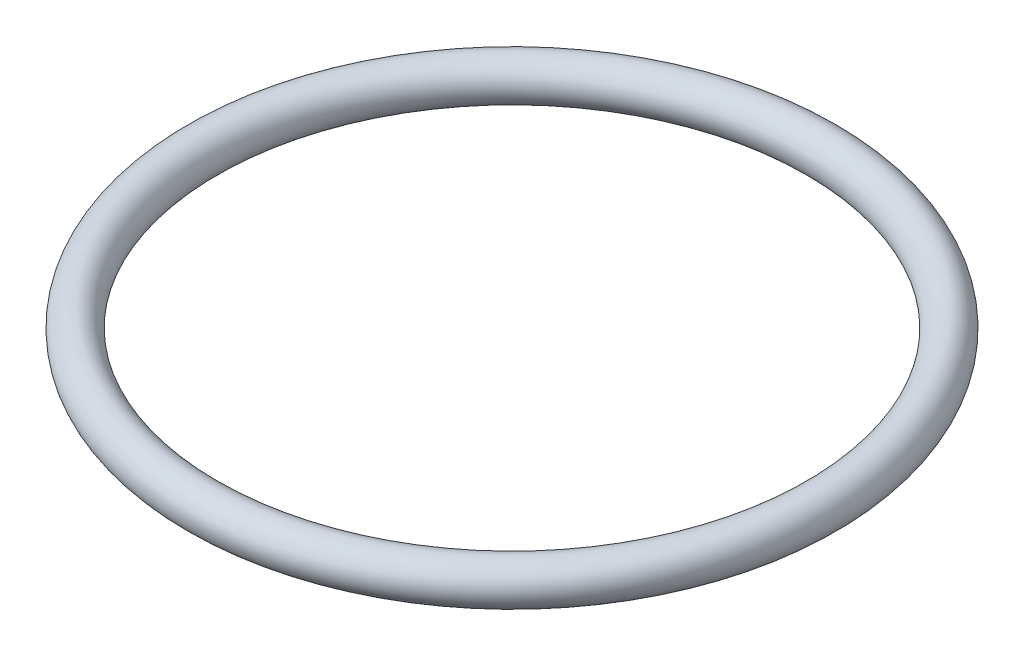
ISO-10303-21;
HEADER;
FILE_DESCRIPTION(('STEP AP214'),'2;1');
FILE_NAME('part.step','',(''),(''),'','','');
FILE_SCHEMA(('AUTOMOTIVE_DESIGN { 1 0 10303 214 1 1 1 1 }'));
ENDSEC;
DATA;
#1=APPLICATION_CONTEXT('core data for automotive mechanical design processes');
#2=APPLICATION_PROTOCOL_DEFINITION('international standard','automotive_design',2000,#1);
#3=PRODUCT_CONTEXT('',#1,'mechanical');
#4=PRODUCT('Part','Part','',(#3));
#5=PRODUCT_RELATED_PRODUCT_CATEGORY('part','',(#4));
#6=PRODUCT_DEFINITION_FORMATION('','',#4);
#7=PRODUCT_DEFINITION_CONTEXT('part definition',#1,'design');
#8=PRODUCT_DEFINITION('design','',#6,#7);
#9=PRODUCT_DEFINITION_SHAPE('','',#8);
#10=(LENGTH_UNIT() NAMED_UNIT(*) SI_UNIT(.MILLI.,.METRE.));
#11=(NAMED_UNIT(*) PLANE_ANGLE_UNIT() SI_UNIT($,.RADIAN.));
#12=(NAMED_UNIT(*) SI_UNIT($,.STERADIAN.) SOLID_ANGLE_UNIT());
#13=UNCERTAINTY_MEASURE_WITH_UNIT(LENGTH_MEASURE(1.E-05),#10,'distance_accuracy_value','');
#14=(GEOMETRIC_REPRESENTATION_CONTEXT(3) GLOBAL_UNCERTAINTY_ASSIGNED_CONTEXT((#13)) GLOBAL_UNIT_ASSIGNED_CONTEXT((#10,
#11,#12)) REPRESENTATION_CONTEXT('',''));
#15=CARTESIAN_POINT('',(0.,0.,0.));
#16=DIRECTION('',(0.,0.,1.));
#17=DIRECTION('',(1.,0.,0.));
#18=AXIS2_PLACEMENT_3D('',#15,#16,#17);
#19=CARTESIAN_POINT('',(0.,0.,0.));
#20=DIRECTION('',(0.,-1.,0.));
#21=DIRECTION('',(0.,0.,-1.));
#22=AXIS2_PLACEMENT_3D('',#19,#20,#21);
#23=TOROIDAL_SURFACE('',#22,23.8125,1.5875);
#24=CARTESIAN_POINT('',(0.,0.,-25.4));
#25=VERTEX_POINT('',#24);
#26=VERTEX_LOOP('',#25);
#27=FACE_BOUND('',#26,.T.);
#28=ADVANCED_FACE('F28',(#27),#23,.T.);
#29=CLOSED_SHELL('',(#28));
#30=MANIFOLD_SOLID_BREP('B2',#29);
#31=ADVANCED_BREP_SHAPE_REPRESENTATION('',(#18,#30),#14);
#32=SHAPE_DEFINITION_REPRESENTATION(#9,#31);
ENDSEC;
END-ISO-10303-21;
